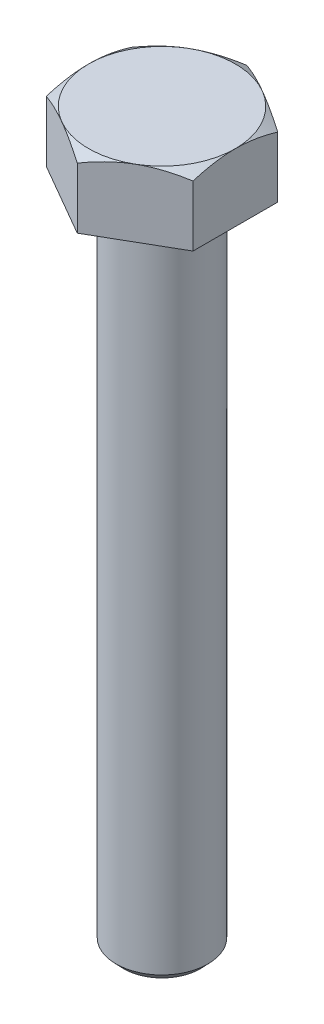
ISO-10303-21;
HEADER;
FILE_DESCRIPTION(('STEP AP214'),'2;1');
FILE_NAME('part.step','',(''),(''),'','','');
FILE_SCHEMA(('AUTOMOTIVE_DESIGN { 1 0 10303 214 1 1 1 1 }'));
ENDSEC;
DATA;
#1=APPLICATION_CONTEXT('core data for automotive mechanical design processes');
#2=APPLICATION_PROTOCOL_DEFINITION('international standard','automotive_design',2000,#1);
#3=PRODUCT_CONTEXT('',#1,'mechanical');
#4=PRODUCT('Part','Part','',(#3));
#5=PRODUCT_RELATED_PRODUCT_CATEGORY('part','',(#4));
#6=PRODUCT_DEFINITION_FORMATION('','',#4);
#7=PRODUCT_DEFINITION_CONTEXT('part definition',#1,'design');
#8=PRODUCT_DEFINITION('design','',#6,#7);
#9=PRODUCT_DEFINITION_SHAPE('','',#8);
#10=(LENGTH_UNIT() NAMED_UNIT(*) SI_UNIT(.MILLI.,.METRE.));
#11=(NAMED_UNIT(*) PLANE_ANGLE_UNIT() SI_UNIT($,.RADIAN.));
#12=(NAMED_UNIT(*) SI_UNIT($,.STERADIAN.) SOLID_ANGLE_UNIT());
#13=UNCERTAINTY_MEASURE_WITH_UNIT(LENGTH_MEASURE(1.E-05),#10,'distance_accuracy_value','');
#14=(GEOMETRIC_REPRESENTATION_CONTEXT(3) GLOBAL_UNCERTAINTY_ASSIGNED_CONTEXT((#13)) GLOBAL_UNIT_ASSIGNED_CONTEXT((#10,
#11,#12)) REPRESENTATION_CONTEXT('',''));
#15=CARTESIAN_POINT('',(0.,0.,0.));
#16=DIRECTION('',(0.,0.,1.));
#17=DIRECTION('',(1.,0.,0.));
#18=AXIS2_PLACEMENT_3D('',#15,#16,#17);
#19=CARTESIAN_POINT('',(0.,0.,0.));
#20=DIRECTION('',(0.,-1.,0.));
#21=DIRECTION('',(0.,0.,-1.));
#22=AXIS2_PLACEMENT_3D('',#19,#20,#21);
#23=PLANE('',#22);
#24=CARTESIAN_POINT('',(0.,0.,0.));
#25=DIRECTION('',(0.,-1.,0.));
#26=DIRECTION('',(0.,0.,-1.));
#27=AXIS2_PLACEMENT_3D('',#24,#25,#26);
#28=CIRCLE('',#27,3.96874999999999);
#29=CARTESIAN_POINT('',(0.,0.,-3.96875));
#30=VERTEX_POINT('',#29);
#31=EDGE_CURVE('E11',#30,#30,#28,.T.);
#32=ORIENTED_EDGE('',*,*,#31,.F.);
#33=EDGE_LOOP('',(#32));
#34=FACE_BOUND('',#33,.T.);
#35=DIRECTION('',(-0.866025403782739,0.,-0.500000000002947));
#36=VECTOR('',#35,1.);
#37=CARTESIAN_POINT('',(-3.17500000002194,0.,5.49926131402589));
#38=LINE('',#37,#36);
#39=CARTESIAN_POINT('',(0.,0.,7.33234841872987));
#40=VERTEX_POINT('',#39);
#41=CARTESIAN_POINT('',(-6.34999999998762,0.,3.66617420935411));
#42=VERTEX_POINT('',#41);
#43=EDGE_CURVE('E104',#40,#42,#38,.T.);
#44=ORIENTED_EDGE('',*,*,#43,.T.);
#45=DIRECTION('',(0.,0.,-1.));
#46=VECTOR('',#45,1.);
#47=CARTESIAN_POINT('',(-6.34999999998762,0.,0.));
#48=LINE('',#47,#46);
#49=CARTESIAN_POINT('',(-6.34999999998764,0.,-3.6661742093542));
#50=VERTEX_POINT('',#49);
#51=EDGE_CURVE('E220',#42,#50,#48,.T.);
#52=ORIENTED_EDGE('',*,*,#51,.T.);
#53=DIRECTION('',(0.86602540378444,0.,-0.500000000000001));
#54=VECTOR('',#53,1.);
#55=CARTESIAN_POINT('',(-3.1749999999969,0.,-5.49926131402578));
#56=LINE('',#55,#54);
#57=CARTESIAN_POINT('',(1.24067423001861E-11,0.,-7.33234841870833));
#58=VERTEX_POINT('',#57);
#59=EDGE_CURVE('E186',#50,#58,#56,.T.);
#60=ORIENTED_EDGE('',*,*,#59,.T.);
#61=DIRECTION('',(0.866025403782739,0.,0.500000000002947));
#62=VECTOR('',#61,1.);
#63=CARTESIAN_POINT('',(3.17500000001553,0.,-5.49926131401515));
#64=LINE('',#63,#62);
#65=CARTESIAN_POINT('',(6.34999999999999,0.,-3.66617420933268));
#66=VERTEX_POINT('',#65);
#67=EDGE_CURVE('E185',#58,#66,#64,.T.);
#68=ORIENTED_EDGE('',*,*,#67,.T.);
#69=DIRECTION('',(0.,0.,1.));
#70=VECTOR('',#69,1.);
#71=CARTESIAN_POINT('',(6.35000000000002,0.,0.));
#72=LINE('',#71,#70);
#73=CARTESIAN_POINT('',(6.34999999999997,0.,3.66617420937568));
#74=VERTEX_POINT('',#73);
#75=EDGE_CURVE('E124',#66,#74,#72,.T.);
#76=ORIENTED_EDGE('',*,*,#75,.T.);
#77=DIRECTION('',(-0.866025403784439,0.,0.500000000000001));
#78=VECTOR('',#77,1.);
#79=CARTESIAN_POINT('',(3.17500000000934,0.,5.49926131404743));
#80=LINE('',#79,#78);
#81=EDGE_CURVE('E115',#74,#40,#80,.T.);
#82=ORIENTED_EDGE('',*,*,#81,.T.);
#83=EDGE_LOOP('',(#44,#52,#60,#68,#76,#82));
#84=FACE_BOUND('',#83,.T.);
#85=ADVANCED_FACE('F36',(#34,#84),#23,.T.);
#86=CARTESIAN_POINT('',(-1.11022302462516E-13,-57.15,-1.66533453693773E-13));
#87=DIRECTION('',(0.,-1.,0.));
#88=DIRECTION('',(0.,0.,-1.));
#89=AXIS2_PLACEMENT_3D('',#86,#87,#88);
#90=PLANE('',#89);
#91=CARTESIAN_POINT('',(-1.11022302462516E-13,-57.15,-1.66533453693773E-13));
#92=DIRECTION('',(0.,-1.,0.));
#93=DIRECTION('',(0.,0.,-1.));
#94=AXIS2_PLACEMENT_3D('',#91,#92,#93);
#95=CIRCLE('',#94,3.3095);
#96=CARTESIAN_POINT('',(-1.11206016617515E-13,-57.15,-3.30950000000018));
#97=VERTEX_POINT('',#96);
#98=EDGE_CURVE('E219',#97,#97,#95,.T.);
#99=ORIENTED_EDGE('',*,*,#98,.T.);
#100=EDGE_LOOP('',(#99));
#101=FACE_BOUND('',#100,.T.);
#102=ADVANCED_FACE('F202',(#101),#90,.T.);
#103=CARTESIAN_POINT('',(-1.11022302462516E-13,-57.15,-1.66533453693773E-13));
#104=DIRECTION('',(0.,1.,0.));
#105=DIRECTION('',(0.,0.,1.));
#106=AXIS2_PLACEMENT_3D('',#103,#104,#105);
#107=CONICAL_SURFACE('',#106,3.3095,0.762249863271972);
#108=CARTESIAN_POINT('',(-1.11022302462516E-13,-56.4595,-1.66533453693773E-13));
#109=DIRECTION('',(0.,-1.,0.));
#110=DIRECTION('',(0.,0.,-1.));
#111=AXIS2_PLACEMENT_3D('',#108,#109,#110);
#112=CIRCLE('',#111,3.96875);
#113=CARTESIAN_POINT('',(-1.11242612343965E-13,-56.4595,-3.96875000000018));
#114=VERTEX_POINT('',#113);
#115=EDGE_CURVE('E217',#114,#114,#112,.T.);
#116=ORIENTED_EDGE('',*,*,#115,.T.);
#117=EDGE_LOOP('',(#116));
#118=FACE_BOUND('',#117,.T.);
#119=ORIENTED_EDGE('',*,*,#98,.F.);
#120=EDGE_LOOP('',(#119));
#121=FACE_BOUND('',#120,.T.);
#122=ADVANCED_FACE('F207',(#118,#121),#107,.T.);
#123=CARTESIAN_POINT('',(0.,0.,0.));
#124=DIRECTION('',(0.,-1.,0.));
#125=DIRECTION('',(0.,0.,-1.));
#126=AXIS2_PLACEMENT_3D('',#123,#124,#125);
#127=CYLINDRICAL_SURFACE('',#126,3.96875);
#128=ORIENTED_EDGE('',*,*,#31,.T.);
#129=EDGE_LOOP('',(#128));
#130=FACE_BOUND('',#129,.T.);
#131=ORIENTED_EDGE('',*,*,#115,.F.);
#132=EDGE_LOOP('',(#131));
#133=FACE_BOUND('',#132,.T.);
#134=ADVANCED_FACE('F211',(#130,#133),#127,.T.);
#135=CARTESIAN_POINT('',(-6.34999999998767,-57.15,-3.66617420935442));
#136=DIRECTION('',(-1.,0.,0.));
#137=DIRECTION('',(0.,0.,1.));
#138=AXIS2_PLACEMENT_3D('',#135,#136,#137);
#139=PLANE('',#138);
#140=DIRECTION('',(0.,1.,0.));
#141=VECTOR('',#140,1.);
#142=CARTESIAN_POINT('',(-6.34999999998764,-57.15,3.66617420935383));
#143=LINE('',#142,#141);
#144=CARTESIAN_POINT('',(-6.34999999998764,5.25140022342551,3.66617420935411));
#145=VERTEX_POINT('',#144);
#146=EDGE_CURVE('E51',#42,#145,#143,.T.);
#147=ORIENTED_EDGE('',*,*,#146,.T.);
#148=CARTESIAN_POINT('',(-6.34999999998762,2.64911838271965,-9.78010077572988));
#149=CARTESIAN_POINT('',(-6.34999999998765,2.78809508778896,-9.50441267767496));
#150=CARTESIAN_POINT('',(-6.34999999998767,2.92574607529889,-9.22804445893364));
#151=CARTESIAN_POINT('',(-6.34999999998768,3.19764714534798,-8.67358394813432));
#152=CARTESIAN_POINT('',(-6.34999999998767,3.33189664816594,-8.39549137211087));
#153=CARTESIAN_POINT('',(-6.34999999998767,3.59698777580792,-7.83564287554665));
#154=CARTESIAN_POINT('',(-6.34999999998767,3.72780422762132,-7.55387499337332));
#155=CARTESIAN_POINT('',(-6.34999999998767,3.98408540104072,-6.98792501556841));
#156=CARTESIAN_POINT('',(-6.34999999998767,4.10955039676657,-6.70374304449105));
#157=CARTESIAN_POINT('',(-6.34999999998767,4.35786086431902,-6.12274465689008));
#158=CARTESIAN_POINT('',(-6.34999999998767,4.48047181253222,-5.82582743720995));
#159=CARTESIAN_POINT('',(-6.34999999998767,4.71635366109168,-5.22823640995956));
#160=CARTESIAN_POINT('',(-6.34999999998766,4.82962339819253,-4.92756213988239));
#161=CARTESIAN_POINT('',(-6.34999999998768,5.04376273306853,-4.3225489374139));
#162=CARTESIAN_POINT('',(-6.34999999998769,5.144659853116,-4.01821985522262));
#163=CARTESIAN_POINT('',(-6.34999999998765,5.33074186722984,-3.40485385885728));
#164=CARTESIAN_POINT('',(-6.34999999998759,5.41593224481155,-3.09581862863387));
#165=CARTESIAN_POINT('',(-6.34999999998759,5.56590789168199,-2.47453597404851));
#166=CARTESIAN_POINT('',(-6.34999999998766,5.63080510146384,-2.16231634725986));
#167=CARTESIAN_POINT('',(-6.34999999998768,5.71000165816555,-1.69095946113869));
#168=CARTESIAN_POINT('',(-6.34999999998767,5.73337662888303,-1.53332485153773));
#169=CARTESIAN_POINT('',(-6.34999999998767,5.7736004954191,-1.21723081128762));
#170=CARTESIAN_POINT('',(-6.34999999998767,5.79045008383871,-1.05877146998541));
#171=CARTESIAN_POINT('',(-6.34999999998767,5.81705294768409,-0.743459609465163));
#172=CARTESIAN_POINT('',(-6.34999999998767,5.82690100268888,-0.586615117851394));
#173=CARTESIAN_POINT('',(-6.34999999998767,5.8396429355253,-0.272644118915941));
#174=CARTESIAN_POINT('',(-6.34999999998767,5.84253692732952,-0.115517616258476));
#175=CARTESIAN_POINT('',(-6.34999999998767,5.8412992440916,0.198713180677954));
#176=CARTESIAN_POINT('',(-6.34999999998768,5.83716735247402,0.355817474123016));
#177=CARTESIAN_POINT('',(-6.34999999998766,5.82198026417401,0.669693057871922));
#178=CARTESIAN_POINT('',(-6.34999999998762,5.81092471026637,0.826464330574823));
#179=CARTESIAN_POINT('',(-6.34999999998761,5.77711478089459,1.19405831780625));
#180=CARTESIAN_POINT('',(-6.34999999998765,5.75162288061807,1.40463318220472));
#181=CARTESIAN_POINT('',(-6.34999999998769,5.68948689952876,1.82411871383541));
#182=CARTESIAN_POINT('',(-6.34999999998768,5.652841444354,2.03302917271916));
#183=CARTESIAN_POINT('',(-6.34999999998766,5.52799473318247,2.65702809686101));
#184=CARTESIAN_POINT('',(-6.34999999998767,5.42490443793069,3.06917678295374));
#185=CARTESIAN_POINT('',(-6.34999999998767,5.24700676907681,3.68530946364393));
#186=CARTESIAN_POINT('',(-6.34999999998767,5.18299762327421,3.89259297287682));
#187=CARTESIAN_POINT('',(-6.34999999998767,5.04850923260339,4.30507004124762));
#188=CARTESIAN_POINT('',(-6.34999999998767,4.97802994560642,4.51026358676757));
#189=CARTESIAN_POINT('',(-6.34999999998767,4.8316782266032,4.91862778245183));
#190=CARTESIAN_POINT('',(-6.34999999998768,4.75580750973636,5.12179905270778));
#191=CARTESIAN_POINT('',(-6.34999999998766,4.59952734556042,5.52638081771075));
#192=CARTESIAN_POINT('',(-6.34999999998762,4.51911794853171,5.72779133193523));
#193=CARTESIAN_POINT('',(-6.34999999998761,4.32463384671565,6.20182368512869));
#194=CARTESIAN_POINT('',(-6.34999999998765,4.20892769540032,6.47377502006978));
#195=CARTESIAN_POINT('',(-6.34999999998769,3.9719132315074,7.01523242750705));
#196=CARTESIAN_POINT('',(-6.34999999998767,3.8506045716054,7.2847383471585));
#197=CARTESIAN_POINT('',(-6.34999999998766,3.60348047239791,7.82173963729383));
#198=CARTESIAN_POINT('',(-6.34999999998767,3.47766408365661,8.08923456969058));
#199=CARTESIAN_POINT('',(-6.34999999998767,3.22240609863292,8.62249227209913));
#200=CARTESIAN_POINT('',(-6.34999999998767,3.09296441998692,8.88825500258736));
#201=CARTESIAN_POINT('',(-6.34999999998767,2.83098544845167,9.41859793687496));
#202=CARTESIAN_POINT('',(-6.34999999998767,2.69844502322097,9.68317659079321));
#203=CARTESIAN_POINT('',(-6.34999999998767,2.43091608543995,10.2110944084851));
#204=CARTESIAN_POINT('',(-6.34999999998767,2.29592754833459,10.4744335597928));
#205=CARTESIAN_POINT('',(-6.34999999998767,1.8879209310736,11.2628940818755));
#206=CARTESIAN_POINT('',(-6.34999999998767,1.61186817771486,11.7864458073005));
#207=CARTESIAN_POINT('',(-6.34999999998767,1.2052904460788,12.5473791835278));
#208=CARTESIAN_POINT('',(-6.34999999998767,1.07703038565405,12.785979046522));
#209=CARTESIAN_POINT('',(-6.34999999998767,0.81946052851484,13.2626059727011));
#210=CARTESIAN_POINT('',(-6.34999999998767,0.690150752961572,13.5006330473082));
#211=CARTESIAN_POINT('',(-6.34999999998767,0.300846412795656,14.2139910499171));
#212=CARTESIAN_POINT('',(-6.34999999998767,0.0394881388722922,14.6885776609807));
#213=CARTESIAN_POINT('',(-6.34999999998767,-0.485310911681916,15.6349428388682));
#214=CARTESIAN_POINT('',(-6.34999999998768,-0.748744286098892,16.1067255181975));
#215=CARTESIAN_POINT('',(-6.34999999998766,-1.27780270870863,17.0490244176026));
#216=CARTESIAN_POINT('',(-6.34999999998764,-1.54342762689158,17.5195407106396));
#217=CARTESIAN_POINT('',(-6.34999999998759,-1.80987590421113,17.9895871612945));
#218=B_SPLINE_CURVE_WITH_KNOTS('',3,(#148,#149,#150,#151,#152,#153,#154,#155,#156,#157,#158,
#159,#160,#161,#162,#163,#164,#165,#166,#167,#168,#169,#170,#171,#172,#173,#174,#175,#176,#177,
#178,#179,#180,#181,#182,#183,#184,#185,#186,#187,#188,#189,#190,#191,#192,#193,#194,#195,#196,
#197,#198,#199,#200,#201,#202,#203,#204,#205,#206,#207,#208,#209,#210,#211,#212,#213,#214,#215,
#216,#217),.UNSPECIFIED.,.F.,.F.,(4,2,2,2,2,2,2,2,2,2,2,2,2,2,2,2,2,2,2,2,2,2,2,2,2,2,2,2,2,2,2,
2,2,2,4),(0.,0.926222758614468,1.85260232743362,2.78452036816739,3.7163906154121,
4.67997972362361,5.64368864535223,6.60521338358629,7.56640179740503,8.52219058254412,
9.00015149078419,9.47806165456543,9.94937238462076,10.4206753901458,10.8919929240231,
11.3633347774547,11.9993187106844,12.6353810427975,13.9081281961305,14.5588965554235,
15.2096691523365,15.8602356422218,16.5107949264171,17.3973384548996,18.2839370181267,
19.1707234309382,20.057530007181,20.9452754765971,21.8330298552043,23.6085812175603,
24.4212456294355,25.233893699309,26.8592616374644,28.4802997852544,30.1012424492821),.UNSPECIFIED.);
#219=CARTESIAN_POINT('',(-6.34999999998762,5.84199999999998,0.));
#220=VERTEX_POINT('',#219);
#221=EDGE_CURVE('E226',#220,#145,#218,.T.);
#222=ORIENTED_EDGE('',*,*,#221,.F.);
#223=CARTESIAN_POINT('',(-6.34999999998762,5.25140022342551,-3.66617420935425));
#224=VERTEX_POINT('',#223);
#225=EDGE_CURVE('E224',#224,#220,#218,.T.);
#226=ORIENTED_EDGE('',*,*,#225,.F.);
#227=DIRECTION('',(0.,1.,0.));
#228=VECTOR('',#227,1.);
#229=CARTESIAN_POINT('',(-6.34999999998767,-57.15,-3.66617420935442));
#230=LINE('',#229,#228);
#231=EDGE_CURVE('E364',#50,#224,#230,.T.);
#232=ORIENTED_EDGE('',*,*,#231,.F.);
#233=ORIENTED_EDGE('',*,*,#51,.F.);
#234=EDGE_LOOP('',(#147,#222,#226,#232,#233));
#235=FACE_BOUND('',#234,.T.);
#236=ADVANCED_FACE('F191',(#235),#139,.T.);
#237=CARTESIAN_POINT('',(1.23512311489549E-11,-57.15,-7.33234841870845));
#238=DIRECTION('',(-0.500000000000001,0.,-0.86602540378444));
#239=DIRECTION('',(-0.86602540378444,0.,0.500000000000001));
#240=AXIS2_PLACEMENT_3D('',#237,#238,#239);
#241=PLANE('',#240);
#242=ORIENTED_EDGE('',*,*,#231,.T.);
#243=CARTESIAN_POINT('',(0.000200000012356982,5.25133079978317,-7.33246388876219));
#244=CARTESIAN_POINT('',(-0.139899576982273,5.29995292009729,-7.25157736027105));
#245=CARTESIAN_POINT('',(-0.280563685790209,5.34637546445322,-7.17036489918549));
#246=CARTESIAN_POINT('',(-0.563131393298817,5.43420062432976,-7.00722435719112));
#247=CARTESIAN_POINT('',(-0.705035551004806,5.4756008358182,-6.92529595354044));
#248=CARTESIAN_POINT('',(-1.13322681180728,5.59144601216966,-6.67807961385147));
#249=CARTESIAN_POINT('',(-1.42134969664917,5.65730624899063,-6.51173178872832));
#250=CARTESIAN_POINT('',(-1.85243320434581,5.73428924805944,-6.26284560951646));
#251=CARTESIAN_POINT('',(-1.99399330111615,5.75615622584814,-6.1811158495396));
#252=CARTESIAN_POINT('',(-2.27780387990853,5.79273514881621,-6.01725773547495));
#253=CARTESIAN_POINT('',(-2.42005429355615,5.80744778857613,-5.93512942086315));
#254=CARTESIAN_POINT('',(-2.70481254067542,5.82932868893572,-5.77072417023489));
#255=CARTESIAN_POINT('',(-2.84731982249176,5.83650644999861,-5.68844755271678));
#256=CARTESIAN_POINT('',(-3.13245850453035,5.84316907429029,-5.52382265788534));
#257=CARTESIAN_POINT('',(-3.27508990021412,5.84265420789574,-5.44147438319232));
#258=CARTESIAN_POINT('',(-3.66332768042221,5.83075651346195,-5.2173251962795));
#259=CARTESIAN_POINT('',(-3.90878593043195,5.81178122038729,-5.07560980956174));
#260=CARTESIAN_POINT('',(-4.397927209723,5.7523266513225,-4.79320396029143));
#261=CARTESIAN_POINT('',(-4.64160819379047,5.71182565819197,-4.65251467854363));
#262=CARTESIAN_POINT('',(-5.13178581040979,5.61085664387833,-4.3695104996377));
#263=CARTESIAN_POINT('',(-5.37821062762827,5.54993471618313,-4.22723706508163));
#264=CARTESIAN_POINT('',(-5.8671067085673,5.41191492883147,-3.94497278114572));
#265=CARTESIAN_POINT('',(-6.10958531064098,5.33485200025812,-3.80497769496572));
#266=CARTESIAN_POINT('',(-6.35019999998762,5.25133079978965,-3.66605873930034));
#267=B_SPLINE_CURVE_WITH_KNOTS('',3,(#243,#244,#245,#246,#247,#248,#249,#250,#251,#252,#253,
#254,#255,#256,#257,#258,#259,#260,#261,#262,#263,#264,#265,#266),.UNSPECIFIED.,.F.,.F.,(4,2,2,
2,2,2,2,2,2,2,2,4),(0.,0.506721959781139,1.01368552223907,2.02993980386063,2.52456025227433,
3.01913267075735,3.51308074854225,4.00701146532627,4.8582523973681,5.71035377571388,
6.58281230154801,7.45340187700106),.UNSPECIFIED.);
#268=CARTESIAN_POINT('',(-3.1749999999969,5.84199999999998,-5.49926131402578));
#269=VERTEX_POINT('',#268);
#270=EDGE_CURVE('E176',#269,#224,#267,.T.);
#271=ORIENTED_EDGE('',*,*,#270,.F.);
#272=CARTESIAN_POINT('',(1.24067423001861E-11,5.25140022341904,-7.33234841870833));
#273=VERTEX_POINT('',#272);
#274=EDGE_CURVE('E184',#273,#269,#267,.T.);
#275=ORIENTED_EDGE('',*,*,#274,.F.);
#276=DIRECTION('',(0.,1.,0.));
#277=VECTOR('',#276,1.);
#278=CARTESIAN_POINT('',(1.23512311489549E-11,-57.15,-7.33234841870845));
#279=LINE('',#278,#277);
#280=EDGE_CURVE('E366',#58,#273,#279,.T.);
#281=ORIENTED_EDGE('',*,*,#280,.F.);
#282=ORIENTED_EDGE('',*,*,#59,.F.);
#283=EDGE_LOOP('',(#242,#271,#275,#281,#282));
#284=FACE_BOUND('',#283,.T.);
#285=ADVANCED_FACE('F187',(#284),#241,.T.);
#286=CARTESIAN_POINT('',(6.34999999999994,-57.15,-3.66617420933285));
#287=DIRECTION('',(0.500000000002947,0.,-0.86602540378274));
#288=DIRECTION('',(-0.866025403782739,0.,-0.500000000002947));
#289=AXIS2_PLACEMENT_3D('',#286,#287,#288);
#290=PLANE('',#289);
#291=ORIENTED_EDGE('',*,*,#280,.T.);
#292=CARTESIAN_POINT('',(6.35019999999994,5.25133079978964,-3.66605873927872));
#293=CARTESIAN_POINT('',(6.21010042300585,5.2999529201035,-3.74694526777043));
#294=CARTESIAN_POINT('',(6.06943631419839,5.34637546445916,-3.82815772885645));
#295=CARTESIAN_POINT('',(5.78686860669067,5.43420062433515,-3.99129827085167));
#296=CARTESIAN_POINT('',(5.64496444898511,5.4756008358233,-4.07322667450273));
#297=CARTESIAN_POINT('',(5.21677318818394,5.59144601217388,-4.32044301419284));
#298=CARTESIAN_POINT('',(4.92865030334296,5.65730624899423,-4.48679083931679));
#299=CARTESIAN_POINT('',(4.49756679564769,5.73428924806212,-4.73567701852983));
#300=CARTESIAN_POINT('',(4.35600669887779,5.75615622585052,-4.81740677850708));
#301=CARTESIAN_POINT('',(4.07219612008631,5.792735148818,-4.98126489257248));
#302=CARTESIAN_POINT('',(3.92994570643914,5.80744778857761,-5.06339320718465));
#303=CARTESIAN_POINT('',(3.64518745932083,5.82932868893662,-5.2277984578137));
#304=CARTESIAN_POINT('',(3.50268017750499,5.83650644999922,-5.31007507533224));
#305=CARTESIAN_POINT('',(3.21754149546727,5.84316907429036,-5.47469997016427));
#306=CARTESIAN_POINT('',(3.07491009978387,5.84265420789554,-5.55704824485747));
#307=CARTESIAN_POINT('',(2.68667231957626,5.83075651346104,-5.78119743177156));
#308=CARTESIAN_POINT('',(2.44121406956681,5.81178122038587,-5.92291281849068));
#309=CARTESIAN_POINT('',(1.95207279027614,5.75232665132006,-6.2053186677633));
#310=CARTESIAN_POINT('',(1.70839180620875,5.71182565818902,-6.34600794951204));
#311=CARTESIAN_POINT('',(1.21821418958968,5.61085664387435,-6.62901212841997));
#312=CARTESIAN_POINT('',(0.97178937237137,5.54993471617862,-6.77128556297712));
#313=CARTESIAN_POINT('',(0.482893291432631,5.41191492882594,-7.05354984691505));
#314=CARTESIAN_POINT('',(0.24041468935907,5.3348520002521,-7.19354493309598));
#315=CARTESIAN_POINT('',(-0.000199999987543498,5.25133079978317,-7.33246388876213));
#316=B_SPLINE_CURVE_WITH_KNOTS('',3,(#292,#293,#294,#295,#296,#297,#298,#299,#300,#301,#302,
#303,#304,#305,#306,#307,#308,#309,#310,#311,#312,#313,#314,#315),.UNSPECIFIED.,.F.,.F.,(4,2,2,
2,2,2,2,2,2,2,2,4),(0.,0.506721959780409,1.01368552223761,2.02993980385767,2.52456025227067,
3.01913267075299,3.5130807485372,4.00701146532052,4.85825239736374,5.71035377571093,
6.58281230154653,7.45340187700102),.UNSPECIFIED.);
#317=CARTESIAN_POINT('',(3.17500000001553,5.84199999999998,-5.49926131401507));
#318=VERTEX_POINT('',#317);
#319=EDGE_CURVE('E169',#318,#273,#316,.T.);
#320=ORIENTED_EDGE('',*,*,#319,.F.);
#321=CARTESIAN_POINT('',(6.34999999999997,5.25140022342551,-3.66617420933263));
#322=VERTEX_POINT('',#321);
#323=EDGE_CURVE('E393',#322,#318,#316,.T.);
#324=ORIENTED_EDGE('',*,*,#323,.F.);
#325=DIRECTION('',(0.,1.,0.));
#326=VECTOR('',#325,1.);
#327=CARTESIAN_POINT('',(6.34999999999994,-57.15,-3.66617420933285));
#328=LINE('',#327,#326);
#329=EDGE_CURVE('E369',#66,#322,#328,.T.);
#330=ORIENTED_EDGE('',*,*,#329,.F.);
#331=ORIENTED_EDGE('',*,*,#67,.F.);
#332=EDGE_LOOP('',(#291,#320,#324,#330,#331));
#333=FACE_BOUND('',#332,.T.);
#334=ADVANCED_FACE('F190',(#333),#290,.T.);
#335=CARTESIAN_POINT('',(6.34999999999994,-57.15,3.66617420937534));
#336=DIRECTION('',(1.,0.,0.));
#337=DIRECTION('',(0.,0.,-1.));
#338=AXIS2_PLACEMENT_3D('',#335,#336,#337);
#339=PLANE('',#338);
#340=ORIENTED_EDGE('',*,*,#329,.T.);
#341=CARTESIAN_POINT('',(6.34999999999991,2.64911838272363,-9.78010077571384));
#342=CARTESIAN_POINT('',(6.34999999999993,2.78809508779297,-9.50441267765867));
#343=CARTESIAN_POINT('',(6.34999999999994,2.9257460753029,-9.22804445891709));
#344=CARTESIAN_POINT('',(6.34999999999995,3.19764714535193,-8.67358394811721));
#345=CARTESIAN_POINT('',(6.34999999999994,3.33189664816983,-8.39549137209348));
#346=CARTESIAN_POINT('',(6.34999999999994,3.59698777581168,-7.83564287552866));
#347=CARTESIAN_POINT('',(6.34999999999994,3.727804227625,-7.55387499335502));
#348=CARTESIAN_POINT('',(6.34999999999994,3.9840854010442,-6.98792501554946));
#349=CARTESIAN_POINT('',(6.34999999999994,4.10955039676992,-6.70374304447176));
#350=CARTESIAN_POINT('',(6.34999999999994,4.35786086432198,-6.12274465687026));
#351=CARTESIAN_POINT('',(6.34999999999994,4.48047181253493,-5.82582743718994));
#352=CARTESIAN_POINT('',(6.34999999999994,4.7163536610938,-5.22823640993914));
#353=CARTESIAN_POINT('',(6.34999999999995,4.82962339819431,-4.92756213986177));
#354=CARTESIAN_POINT('',(6.34999999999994,5.04376273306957,-4.32254893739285));
#355=CARTESIAN_POINT('',(6.34999999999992,5.14465985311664,-4.01821985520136));
#356=CARTESIAN_POINT('',(6.34999999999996,5.3307418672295,-3.40485385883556));
#357=CARTESIAN_POINT('',(6.35000000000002,5.41593224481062,-3.09581862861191));
#358=CARTESIAN_POINT('',(6.35000000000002,5.56590789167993,-2.47453597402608));
#359=CARTESIAN_POINT('',(6.34999999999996,5.63080510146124,-2.1623163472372));
#360=CARTESIAN_POINT('',(6.34999999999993,5.71000165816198,-1.6909594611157));
#361=CARTESIAN_POINT('',(6.34999999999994,5.73337662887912,-1.53332485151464));
#362=CARTESIAN_POINT('',(6.34999999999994,5.77360049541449,-1.21723081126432));
#363=CARTESIAN_POINT('',(6.34999999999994,5.79045008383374,-1.05877146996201));
#364=CARTESIAN_POINT('',(6.34999999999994,5.81705294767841,-0.743459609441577));
#365=CARTESIAN_POINT('',(6.34999999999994,5.82690100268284,-0.58661511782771));
#366=CARTESIAN_POINT('',(6.34999999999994,5.83964293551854,-0.27264411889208));
#367=CARTESIAN_POINT('',(6.34999999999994,5.84253692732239,-0.115517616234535));
#368=CARTESIAN_POINT('',(6.34999999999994,5.84129924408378,0.198713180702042));
#369=CARTESIAN_POINT('',(6.34999999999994,5.83716735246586,0.355817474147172));
#370=CARTESIAN_POINT('',(6.34999999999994,5.82198026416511,0.669693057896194));
#371=CARTESIAN_POINT('',(6.34999999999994,5.81092471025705,0.826464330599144));
#372=CARTESIAN_POINT('',(6.34999999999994,5.77711478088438,1.19405831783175));
#373=CARTESIAN_POINT('',(6.34999999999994,5.75162288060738,1.40463318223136));
#374=CARTESIAN_POINT('',(6.34999999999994,5.68948689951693,1.82411871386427));
#375=CARTESIAN_POINT('',(6.34999999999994,5.6528414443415,2.0330291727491));
#376=CARTESIAN_POINT('',(6.34999999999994,5.52799473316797,2.65702809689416));
#377=CARTESIAN_POINT('',(6.34999999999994,5.42490443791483,3.06917678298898));
#378=CARTESIAN_POINT('',(6.34999999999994,5.24700676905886,3.68530946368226));
#379=CARTESIAN_POINT('',(6.34999999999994,5.18299762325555,3.89259297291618));
#380=CARTESIAN_POINT('',(6.34999999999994,5.04850923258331,4.30507004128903));
#381=CARTESIAN_POINT('',(6.34999999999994,4.97802994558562,4.51026358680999));
#382=CARTESIAN_POINT('',(6.34999999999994,4.83167822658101,4.91862778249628));
#383=CARTESIAN_POINT('',(6.34999999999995,4.75580750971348,5.12179905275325));
#384=CARTESIAN_POINT('',(6.34999999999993,4.59952734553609,5.52638081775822));
#385=CARTESIAN_POINT('',(6.34999999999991,4.51911794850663,5.72779133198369));
#386=CARTESIAN_POINT('',(6.34999999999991,4.32463384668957,6.20182368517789));
#387=CARTESIAN_POINT('',(6.34999999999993,4.20892769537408,6.47377502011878));
#388=CARTESIAN_POINT('',(6.34999999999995,3.97191323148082,7.01523242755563));
#389=CARTESIAN_POINT('',(6.34999999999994,3.85060457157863,7.28473834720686));
#390=CARTESIAN_POINT('',(6.34999999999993,3.60348047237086,7.82173963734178));
#391=CARTESIAN_POINT('',(6.34999999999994,3.47766408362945,8.08923456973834));
#392=CARTESIAN_POINT('',(6.34999999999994,3.2224060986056,8.62249227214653));
#393=CARTESIAN_POINT('',(6.34999999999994,3.09296441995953,8.88825500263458));
#394=CARTESIAN_POINT('',(6.34999999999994,2.83098544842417,9.41859793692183));
#395=CARTESIAN_POINT('',(6.34999999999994,2.69844502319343,9.68317659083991));
#396=CARTESIAN_POINT('',(6.34999999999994,2.43091608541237,10.2110944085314));
#397=CARTESIAN_POINT('',(6.34999999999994,2.295927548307,10.474433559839));
#398=CARTESIAN_POINT('',(6.34999999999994,1.887920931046,11.2628940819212));
#399=CARTESIAN_POINT('',(6.34999999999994,1.61186817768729,11.7864458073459));
#400=CARTESIAN_POINT('',(6.34999999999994,1.20529044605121,12.547379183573));
#401=CARTESIAN_POINT('',(6.34999999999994,1.07703038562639,12.7859790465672));
#402=CARTESIAN_POINT('',(6.34999999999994,0.819460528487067,13.2626059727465));
#403=CARTESIAN_POINT('',(6.34999999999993,0.690150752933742,13.5006330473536));
#404=CARTESIAN_POINT('',(6.34999999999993,0.30084641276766,14.2139910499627));
#405=CARTESIAN_POINT('',(6.34999999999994,0.039488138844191,14.6885776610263));
#406=CARTESIAN_POINT('',(6.34999999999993,-0.485310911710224,15.634942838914));
#407=CARTESIAN_POINT('',(6.34999999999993,-0.748744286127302,16.1067255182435));
#408=CARTESIAN_POINT('',(6.34999999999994,-1.27780270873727,17.0490244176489));
#409=CARTESIAN_POINT('',(6.34999999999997,-1.54342762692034,17.519540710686));
#410=CARTESIAN_POINT('',(6.35000000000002,-1.80987590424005,17.989587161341));
#411=B_SPLINE_CURVE_WITH_KNOTS('',3,(#341,#342,#343,#344,#345,#346,#347,#348,#349,#350,#351,
#352,#353,#354,#355,#356,#357,#358,#359,#360,#361,#362,#363,#364,#365,#366,#367,#368,#369,#370,
#371,#372,#373,#374,#375,#376,#377,#378,#379,#380,#381,#382,#383,#384,#385,#386,#387,#388,#389,
#390,#391,#392,#393,#394,#395,#396,#397,#398,#399,#400,#401,#402,#403,#404,#405,#406,#407,#408,
#409,#410),.UNSPECIFIED.,.F.,.F.,(4,2,2,2,2,2,2,2,2,2,2,2,2,2,2,2,2,2,2,2,2,2,2,2,2,2,2,2,2,2,2,
2,2,2,4),(0.,0.926222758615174,1.85260232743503,2.78452036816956,3.71639061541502,
4.67997972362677,5.64368864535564,6.60521338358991,7.56640179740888,8.52219058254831,
9.00015149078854,9.47806165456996,9.94937238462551,10.4206753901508,10.8919929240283,
11.3633347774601,11.9993187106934,12.63538104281,13.9081281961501,14.5588965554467,
15.2096691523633,15.8602356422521,16.510794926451,17.3973384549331,18.2839370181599,
19.170723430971,20.0575300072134,20.9452754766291,21.8330298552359,23.608581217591,
24.4212456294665,25.2338936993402,26.859261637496,28.4802997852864,30.1012424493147),.UNSPECIFIED.);
#412=CARTESIAN_POINT('',(6.35000000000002,5.84199999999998,0.));
#413=VERTEX_POINT('',#412);
#414=EDGE_CURVE('E125',#413,#322,#411,.F.);
#415=ORIENTED_EDGE('',*,*,#414,.F.);
#416=CARTESIAN_POINT('',(6.34999999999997,5.25140022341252,3.66617420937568));
#417=VERTEX_POINT('',#416);
#418=EDGE_CURVE('E128',#417,#413,#411,.F.);
#419=ORIENTED_EDGE('',*,*,#418,.F.);
#420=DIRECTION('',(0.,1.,0.));
#421=VECTOR('',#420,1.);
#422=CARTESIAN_POINT('',(6.34999999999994,-57.15,3.66617420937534));
#423=LINE('',#422,#421);
#424=EDGE_CURVE('E120',#74,#417,#423,.T.);
#425=ORIENTED_EDGE('',*,*,#424,.F.);
#426=ORIENTED_EDGE('',*,*,#75,.F.);
#427=EDGE_LOOP('',(#340,#415,#419,#425,#426));
#428=FACE_BOUND('',#427,.T.);
#429=ADVANCED_FACE('F143',(#428),#339,.T.);
#430=CARTESIAN_POINT('',(0.,-57.15,7.33234841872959));
#431=DIRECTION('',(0.500000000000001,0.,0.86602540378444));
#432=DIRECTION('',(0.866025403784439,0.,-0.500000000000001));
#433=AXIS2_PLACEMENT_3D('',#430,#431,#432);
#434=PLANE('',#433);
#435=ORIENTED_EDGE('',*,*,#424,.T.);
#436=CARTESIAN_POINT('',(-0.000200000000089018,5.25133079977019,7.33246388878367));
#437=CARTESIAN_POINT('',(0.139899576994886,5.29995292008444,7.25157736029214));
#438=CARTESIAN_POINT('',(0.280563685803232,5.34637546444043,7.17036489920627));
#439=CARTESIAN_POINT('',(0.563131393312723,5.434200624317,7.00722435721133));
#440=CARTESIAN_POINT('',(0.705035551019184,5.4756008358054,6.92529595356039));
#441=CARTESIAN_POINT('',(1.13322681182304,5.59144601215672,6.67807961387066));
#442=CARTESIAN_POINT('',(1.42134969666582,5.65730624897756,6.51173178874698));
#443=CARTESIAN_POINT('',(1.85243320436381,5.73428924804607,6.26284560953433));
#444=CARTESIAN_POINT('',(1.9939933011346,5.75615622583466,6.1811158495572));
#445=CARTESIAN_POINT('',(2.27780387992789,5.79273514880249,6.01725773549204));
#446=CARTESIAN_POINT('',(2.42005429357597,5.80744778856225,5.93512942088));
#447=CARTESIAN_POINT('',(2.70481254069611,5.82932868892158,5.77072417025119));
#448=CARTESIAN_POINT('',(2.84731982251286,5.83650644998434,5.68844755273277));
#449=CARTESIAN_POINT('',(3.13245850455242,5.84316907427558,5.52382265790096));
#450=CARTESIAN_POINT('',(3.27508990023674,5.84265420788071,5.44147438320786));
#451=CARTESIAN_POINT('',(3.66332768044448,5.83075651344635,5.21732519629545));
#452=CARTESIAN_POINT('',(3.90878593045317,5.81178122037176,5.0756098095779));
#453=CARTESIAN_POINT('',(4.39792720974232,5.75232665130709,4.79320396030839));
#454=CARTESIAN_POINT('',(4.64160819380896,5.71182565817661,4.65251467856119));
#455=CARTESIAN_POINT('',(5.13178581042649,5.61085664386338,4.36951049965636));
#456=CARTESIAN_POINT('',(5.37821062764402,5.54993471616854,4.22723706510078));
#457=CARTESIAN_POINT('',(5.86710670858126,5.41191492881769,3.94497278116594));
#458=CARTESIAN_POINT('',(6.1095853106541,5.33485200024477,3.80497769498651));
#459=CARTESIAN_POINT('',(6.35019999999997,5.25133079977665,3.66605873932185));
#460=B_SPLINE_CURVE_WITH_KNOTS('',3,(#436,#437,#438,#439,#440,#441,#442,#443,#444,#445,#446,
#447,#448,#449,#450,#451,#452,#453,#454,#455,#456,#457,#458,#459),.UNSPECIFIED.,.F.,.F.,(4,2,2,
2,2,2,2,2,2,2,2,4),(0.,0.506721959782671,1.01368552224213,2.02993980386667,2.52456025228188,
3.01913267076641,3.51308074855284,4.00701146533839,4.8582523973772,5.71035377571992,
6.58281230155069,7.45340187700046),.UNSPECIFIED.);
#461=CARTESIAN_POINT('',(3.17500000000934,5.84200000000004,5.49926131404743));
#462=VERTEX_POINT('',#461);
#463=EDGE_CURVE('E109',#462,#417,#460,.T.);
#464=ORIENTED_EDGE('',*,*,#463,.F.);
#465=CARTESIAN_POINT('',(0.,5.25140022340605,7.33234841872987));
#466=VERTEX_POINT('',#465);
#467=EDGE_CURVE('E118',#466,#462,#460,.T.);
#468=ORIENTED_EDGE('',*,*,#467,.F.);
#469=DIRECTION('',(0.,1.,0.));
#470=VECTOR('',#469,1.);
#471=CARTESIAN_POINT('',(0.,-57.15,7.33234841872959));
#472=LINE('',#471,#470);
#473=EDGE_CURVE('E57',#40,#466,#472,.T.);
#474=ORIENTED_EDGE('',*,*,#473,.F.);
#475=ORIENTED_EDGE('',*,*,#81,.F.);
#476=EDGE_LOOP('',(#435,#464,#468,#474,#475));
#477=FACE_BOUND('',#476,.T.);
#478=ADVANCED_FACE('F114',(#477),#434,.T.);
#479=CARTESIAN_POINT('',(-6.34999999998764,-57.15,3.66617420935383));
#480=DIRECTION('',(-0.500000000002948,0.,0.866025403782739));
#481=DIRECTION('',(0.866025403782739,0.,0.500000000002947));
#482=AXIS2_PLACEMENT_3D('',#479,#480,#481);
#483=PLANE('',#482);
#484=ORIENTED_EDGE('',*,*,#473,.T.);
#485=CARTESIAN_POINT('',(-6.35019999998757,5.25133079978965,3.6660587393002));
#486=CARTESIAN_POINT('',(-6.21010042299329,5.29995292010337,3.74694526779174));
#487=CARTESIAN_POINT('',(-6.0694363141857,5.34637546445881,3.82815772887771));
#488=CARTESIAN_POINT('',(-5.78686860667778,5.43420062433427,3.99129827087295));
#489=CARTESIAN_POINT('',(-5.64496444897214,5.47560083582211,4.07322667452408));
#490=CARTESIAN_POINT('',(-5.21677318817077,5.59144601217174,4.32044301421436));
#491=CARTESIAN_POINT('',(-4.92865030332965,5.65730624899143,4.48679083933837));
#492=CARTESIAN_POINT('',(-4.49756679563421,5.73428924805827,4.73567701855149));
#493=CARTESIAN_POINT('',(-4.35600669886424,5.75615622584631,4.81740677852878));
#494=CARTESIAN_POINT('',(-4.07219612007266,5.79273514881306,4.98126489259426));
#495=CARTESIAN_POINT('',(-3.92994570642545,5.8074477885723,5.06339320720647));
#496=CARTESIAN_POINT('',(-3.64518745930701,5.82932868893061,5.22779845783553));
#497=CARTESIAN_POINT('',(-3.5026801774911,5.83650644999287,5.31007507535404));
#498=CARTESIAN_POINT('',(-3.2175414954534,5.84316907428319,5.47469997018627));
#499=CARTESIAN_POINT('',(-3.07491009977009,5.84265420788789,5.55704824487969));
#500=CARTESIAN_POINT('',(-2.6866723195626,5.83075651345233,5.78119743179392));
#501=CARTESIAN_POINT('',(-2.44121406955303,5.8117812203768,5.92291281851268));
#502=CARTESIAN_POINT('',(-1.95207279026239,5.7523266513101,6.20531866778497));
#503=CARTESIAN_POINT('',(-1.70839180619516,5.71182565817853,6.34600794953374));
#504=CARTESIAN_POINT('',(-1.21821418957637,5.610856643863,6.62901212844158));
#505=CARTESIAN_POINT('',(-0.971789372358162,5.54993471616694,6.77128556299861));
#506=CARTESIAN_POINT('',(-0.482893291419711,5.41191492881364,7.05354984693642));
#507=CARTESIAN_POINT('',(-0.240414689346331,5.33485200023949,7.19354493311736));
#508=CARTESIAN_POINT('',(0.000199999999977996,5.25133079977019,7.3324638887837));
#509=B_SPLINE_CURVE_WITH_KNOTS('',3,(#485,#486,#487,#488,#489,#490,#491,#492,#493,#494,#495,
#496,#497,#498,#499,#500,#501,#502,#503,#504,#505,#506,#507,#508),.UNSPECIFIED.,.F.,.F.,(4,2,2,
2,2,2,2,2,2,2,2,4),(0.,0.506721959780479,1.01368552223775,2.02993980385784,2.52456025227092,
3.01913267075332,3.51308074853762,4.00701146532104,4.85825239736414,5.71035377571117,
6.58281230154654,7.45340187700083),.UNSPECIFIED.);
#510=CARTESIAN_POINT('',(-3.17500000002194,5.84199999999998,5.49926131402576));
#511=VERTEX_POINT('',#510);
#512=EDGE_CURVE('E158',#511,#466,#509,.T.);
#513=ORIENTED_EDGE('',*,*,#512,.F.);
#514=EDGE_CURVE('E110',#145,#511,#509,.T.);
#515=ORIENTED_EDGE('',*,*,#514,.F.);
#516=ORIENTED_EDGE('',*,*,#146,.F.);
#517=ORIENTED_EDGE('',*,*,#43,.F.);
#518=EDGE_LOOP('',(#484,#513,#515,#516,#517));
#519=FACE_BOUND('',#518,.T.);
#520=ADVANCED_FACE('F105',(#519),#483,.T.);
#521=CARTESIAN_POINT('',(0.,4.84999999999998,0.));
#522=DIRECTION('',(0.,-1.,0.));
#523=DIRECTION('',(0.,0.,-1.));
#524=AXIS2_PLACEMENT_3D('',#521,#522,#523);
#525=CONICAL_SURFACE('',#524,8.,1.02948603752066);
#526=ORIENTED_EDGE('',*,*,#463,.T.);
#527=ORIENTED_EDGE('',*,*,#418,.T.);
#528=CARTESIAN_POINT('',(0.,5.84199999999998,0.));
#529=DIRECTION('',(0.,-1.,0.));
#530=DIRECTION('',(0.,0.,-1.));
#531=AXIS2_PLACEMENT_3D('',#528,#529,#530);
#532=CIRCLE('',#531,6.35);
#533=EDGE_CURVE('E380',#413,#462,#532,.T.);
#534=ORIENTED_EDGE('',*,*,#533,.T.);
#535=EDGE_LOOP('',(#526,#527,#534));
#536=FACE_BOUND('',#535,.T.);
#537=ADVANCED_FACE('F284',(#536),#525,.T.);
#538=EDGE_CURVE('E377',#511,#220,#532,.T.);
#539=ORIENTED_EDGE('',*,*,#538,.T.);
#540=ORIENTED_EDGE('',*,*,#221,.T.);
#541=ORIENTED_EDGE('',*,*,#514,.T.);
#542=EDGE_LOOP('',(#539,#540,#541));
#543=FACE_BOUND('',#542,.T.);
#544=ADVANCED_FACE('F292',(#543),#525,.T.);
#545=EDGE_CURVE('E379',#220,#269,#532,.T.);
#546=ORIENTED_EDGE('',*,*,#545,.T.);
#547=ORIENTED_EDGE('',*,*,#270,.T.);
#548=ORIENTED_EDGE('',*,*,#225,.T.);
#549=EDGE_LOOP('',(#546,#547,#548));
#550=FACE_BOUND('',#549,.T.);
#551=ADVANCED_FACE('F294',(#550),#525,.T.);
#552=EDGE_CURVE('E223',#269,#318,#532,.T.);
#553=ORIENTED_EDGE('',*,*,#552,.T.);
#554=ORIENTED_EDGE('',*,*,#319,.T.);
#555=ORIENTED_EDGE('',*,*,#274,.T.);
#556=EDGE_LOOP('',(#553,#554,#555));
#557=FACE_BOUND('',#556,.T.);
#558=ADVANCED_FACE('F151',(#557),#525,.T.);
#559=ORIENTED_EDGE('',*,*,#414,.T.);
#560=ORIENTED_EDGE('',*,*,#323,.T.);
#561=EDGE_CURVE('E39',#318,#413,#532,.T.);
#562=ORIENTED_EDGE('',*,*,#561,.T.);
#563=EDGE_LOOP('',(#559,#560,#562));
#564=FACE_BOUND('',#563,.T.);
#565=ADVANCED_FACE('F146',(#564),#525,.T.);
#566=CARTESIAN_POINT('',(6.35000000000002,5.84199999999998,0.));
#567=DIRECTION('',(0.,1.,0.));
#568=DIRECTION('',(0.,0.,1.));
#569=AXIS2_PLACEMENT_3D('',#566,#567,#568);
#570=PLANE('',#569);
#571=ORIENTED_EDGE('',*,*,#561,.F.);
#572=ORIENTED_EDGE('',*,*,#552,.F.);
#573=ORIENTED_EDGE('',*,*,#545,.F.);
#574=ORIENTED_EDGE('',*,*,#538,.F.);
#575=EDGE_CURVE('E362',#462,#511,#532,.T.);
#576=ORIENTED_EDGE('',*,*,#575,.F.);
#577=ORIENTED_EDGE('',*,*,#533,.F.);
#578=EDGE_LOOP('',(#571,#572,#573,#574,#576,#577));
#579=FACE_BOUND('',#578,.T.);
#580=ADVANCED_FACE('F150',(#579),#570,.T.);
#581=ORIENTED_EDGE('',*,*,#512,.T.);
#582=ORIENTED_EDGE('',*,*,#467,.T.);
#583=ORIENTED_EDGE('',*,*,#575,.T.);
#584=EDGE_LOOP('',(#581,#582,#583));
#585=FACE_BOUND('',#584,.T.);
#586=ADVANCED_FACE('F153',(#585),#525,.T.);
#587=CLOSED_SHELL('',(#85,#102,#122,#134,#236,#285,#334,#429,#478,#520,#537,#544,#551,#558,#565,
#580,#586));
#588=MANIFOLD_SOLID_BREP('B2',#587);
#589=ADVANCED_BREP_SHAPE_REPRESENTATION('',(#18,#588),#14);
#590=SHAPE_DEFINITION_REPRESENTATION(#9,#589);
ENDSEC;
END-ISO-10303-21;
